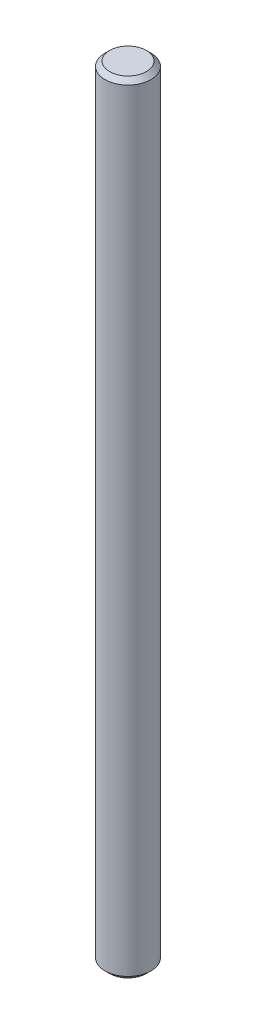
ISO-10303-21;
HEADER;
FILE_DESCRIPTION(('STEP AP214'),'2;1');
FILE_NAME('part.step','',(''),(''),'','','');
FILE_SCHEMA(('AUTOMOTIVE_DESIGN { 1 0 10303 214 1 1 1 1 }'));
ENDSEC;
DATA;
#1=APPLICATION_CONTEXT('core data for automotive mechanical design processes');
#2=APPLICATION_PROTOCOL_DEFINITION('international standard','automotive_design',2000,#1);
#3=PRODUCT_CONTEXT('',#1,'mechanical');
#4=PRODUCT('Part','Part','',(#3));
#5=PRODUCT_RELATED_PRODUCT_CATEGORY('part','',(#4));
#6=PRODUCT_DEFINITION_FORMATION('','',#4);
#7=PRODUCT_DEFINITION_CONTEXT('part definition',#1,'design');
#8=PRODUCT_DEFINITION('design','',#6,#7);
#9=PRODUCT_DEFINITION_SHAPE('','',#8);
#10=(LENGTH_UNIT() NAMED_UNIT(*) SI_UNIT(.MILLI.,.METRE.));
#11=(NAMED_UNIT(*) PLANE_ANGLE_UNIT() SI_UNIT($,.RADIAN.));
#12=(NAMED_UNIT(*) SI_UNIT($,.STERADIAN.) SOLID_ANGLE_UNIT());
#13=UNCERTAINTY_MEASURE_WITH_UNIT(LENGTH_MEASURE(1.E-05),#10,'distance_accuracy_value','');
#14=(GEOMETRIC_REPRESENTATION_CONTEXT(3) GLOBAL_UNCERTAINTY_ASSIGNED_CONTEXT((#13)) GLOBAL_UNIT_ASSIGNED_CONTEXT((#10,
#11,#12)) REPRESENTATION_CONTEXT('',''));
#15=CARTESIAN_POINT('',(0.,0.,0.));
#16=DIRECTION('',(0.,0.,1.));
#17=DIRECTION('',(1.,0.,0.));
#18=AXIS2_PLACEMENT_3D('',#15,#16,#17);
#19=CARTESIAN_POINT('',(0.,68.,0.));
#20=DIRECTION('',(0.,-1.,0.));
#21=DIRECTION('',(0.,0.,-1.));
#22=AXIS2_PLACEMENT_3D('',#19,#20,#21);
#23=CYLINDRICAL_SURFACE('',#22,2.);
#24=CARTESIAN_POINT('',(0.,0.399999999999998,0.));
#25=DIRECTION('',(0.,1.,0.));
#26=DIRECTION('',(0.,0.,1.));
#27=AXIS2_PLACEMENT_3D('',#24,#25,#26);
#28=CIRCLE('',#27,2.);
#29=CARTESIAN_POINT('',(0.,0.399999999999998,2.));
#30=VERTEX_POINT('',#29);
#31=EDGE_CURVE('E40',#30,#30,#28,.T.);
#32=ORIENTED_EDGE('',*,*,#31,.T.);
#33=EDGE_LOOP('',(#32));
#34=FACE_BOUND('',#33,.T.);
#35=CARTESIAN_POINT('',(0.,67.6,0.));
#36=DIRECTION('',(0.,1.,0.));
#37=DIRECTION('',(0.,0.,1.));
#38=AXIS2_PLACEMENT_3D('',#35,#36,#37);
#39=CIRCLE('',#38,2.);
#40=CARTESIAN_POINT('',(0.,67.6,2.));
#41=VERTEX_POINT('',#40);
#42=EDGE_CURVE('E44',#41,#41,#39,.F.);
#43=ORIENTED_EDGE('',*,*,#42,.T.);
#44=EDGE_LOOP('',(#43));
#45=FACE_BOUND('',#44,.T.);
#46=ADVANCED_FACE('F29',(#34,#45),#23,.T.);
#47=CARTESIAN_POINT('',(0.,68.,0.));
#48=DIRECTION('',(0.,1.,0.));
#49=DIRECTION('',(0.,0.,1.));
#50=AXIS2_PLACEMENT_3D('',#47,#48,#49);
#51=PLANE('',#50);
#52=CARTESIAN_POINT('',(0.,68.,0.));
#53=DIRECTION('',(0.,1.,0.));
#54=DIRECTION('',(0.,0.,1.));
#55=AXIS2_PLACEMENT_3D('',#52,#53,#54);
#56=CIRCLE('',#55,1.60000000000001);
#57=CARTESIAN_POINT('',(0.,68.,1.60000000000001));
#58=VERTEX_POINT('',#57);
#59=EDGE_CURVE('E10',#58,#58,#56,.T.);
#60=ORIENTED_EDGE('',*,*,#59,.T.);
#61=EDGE_LOOP('',(#60));
#62=FACE_BOUND('',#61,.T.);
#63=ADVANCED_FACE('F60',(#62),#51,.T.);
#64=CARTESIAN_POINT('',(0.,0.,0.));
#65=DIRECTION('',(0.,1.,0.));
#66=DIRECTION('',(0.,0.,1.));
#67=AXIS2_PLACEMENT_3D('',#64,#65,#66);
#68=PLANE('',#67);
#69=CARTESIAN_POINT('',(0.,0.,0.));
#70=DIRECTION('',(0.,1.,0.));
#71=DIRECTION('',(0.,0.,1.));
#72=AXIS2_PLACEMENT_3D('',#69,#70,#71);
#73=CIRCLE('',#72,1.6);
#74=CARTESIAN_POINT('',(0.,0.,1.6));
#75=VERTEX_POINT('',#74);
#76=EDGE_CURVE('E36',#75,#75,#73,.F.);
#77=ORIENTED_EDGE('',*,*,#76,.T.);
#78=EDGE_LOOP('',(#77));
#79=FACE_BOUND('',#78,.T.);
#80=ADVANCED_FACE('F57',(#79),#68,.F.);
#81=CARTESIAN_POINT('',(0.,0.399999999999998,0.));
#82=DIRECTION('',(0.,1.,0.));
#83=DIRECTION('',(0.,0.,1.));
#84=AXIS2_PLACEMENT_3D('',#81,#82,#83);
#85=CONICAL_SURFACE('',#84,2.,0.785398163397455);
#86=ORIENTED_EDGE('',*,*,#76,.F.);
#87=EDGE_LOOP('',(#86));
#88=FACE_BOUND('',#87,.T.);
#89=ORIENTED_EDGE('',*,*,#31,.F.);
#90=EDGE_LOOP('',(#89));
#91=FACE_BOUND('',#90,.T.);
#92=ADVANCED_FACE('F53',(#88,#91),#85,.T.);
#93=CARTESIAN_POINT('',(0.,68.,0.));
#94=DIRECTION('',(0.,-1.,0.));
#95=DIRECTION('',(0.,0.,-1.));
#96=AXIS2_PLACEMENT_3D('',#93,#94,#95);
#97=CONICAL_SURFACE('',#96,1.60000000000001,0.785398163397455);
#98=ORIENTED_EDGE('',*,*,#42,.F.);
#99=EDGE_LOOP('',(#98));
#100=FACE_BOUND('',#99,.T.);
#101=ORIENTED_EDGE('',*,*,#59,.F.);
#102=EDGE_LOOP('',(#101));
#103=FACE_BOUND('',#102,.T.);
#104=ADVANCED_FACE('F31',(#100,#103),#97,.T.);
#105=CLOSED_SHELL('',(#46,#63,#80,#92,#104));
#106=MANIFOLD_SOLID_BREP('B2',#105);
#107=ADVANCED_BREP_SHAPE_REPRESENTATION('',(#18,#106),#14);
#108=SHAPE_DEFINITION_REPRESENTATION(#9,#107);
ENDSEC;
END-ISO-10303-21;
